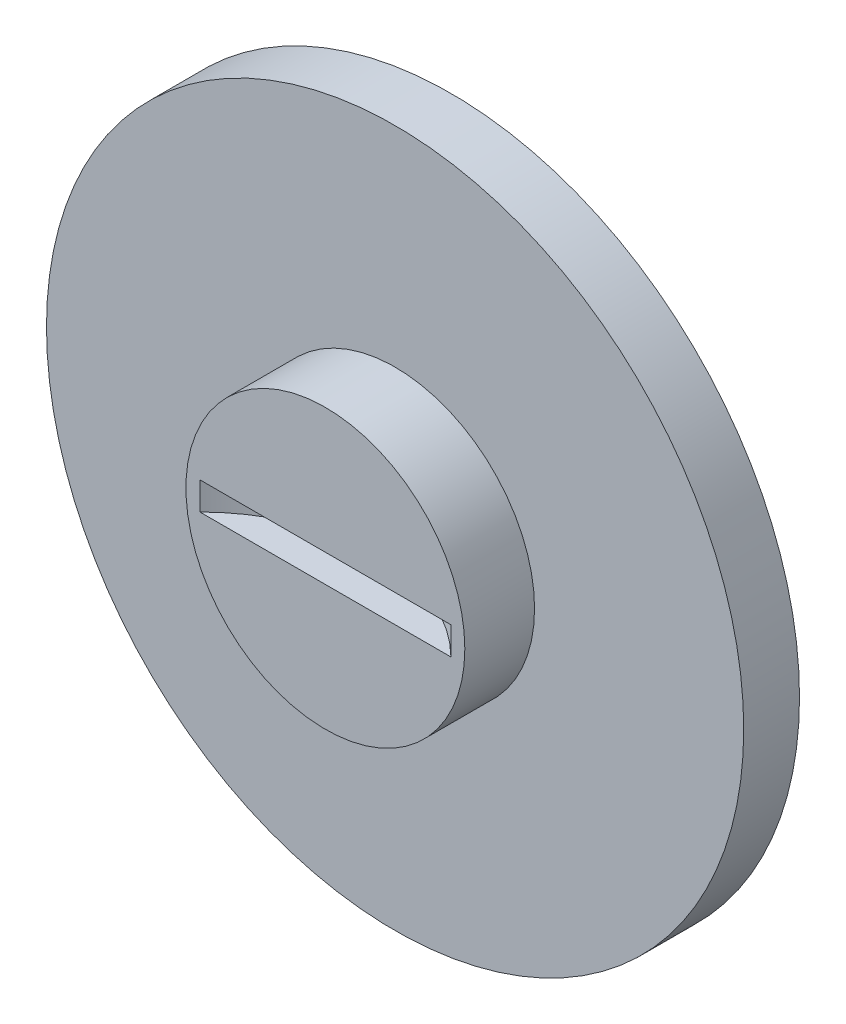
ISO-10303-21;
HEADER;
FILE_DESCRIPTION(('STEP AP214'),'2;1');
FILE_NAME('part.step','',(''),(''),'','','');
FILE_SCHEMA(('AUTOMOTIVE_DESIGN { 1 0 10303 214 1 1 1 1 }'));
ENDSEC;
DATA;
#1=APPLICATION_CONTEXT('core data for automotive mechanical design processes');
#2=APPLICATION_PROTOCOL_DEFINITION('international standard','automotive_design',2000,#1);
#3=PRODUCT_CONTEXT('',#1,'mechanical');
#4=PRODUCT('Part','Part','',(#3));
#5=PRODUCT_RELATED_PRODUCT_CATEGORY('part','',(#4));
#6=PRODUCT_DEFINITION_FORMATION('','',#4);
#7=PRODUCT_DEFINITION_CONTEXT('part definition',#1,'design');
#8=PRODUCT_DEFINITION('design','',#6,#7);
#9=PRODUCT_DEFINITION_SHAPE('','',#8);
#10=(LENGTH_UNIT() NAMED_UNIT(*) SI_UNIT(.MILLI.,.METRE.));
#11=(NAMED_UNIT(*) PLANE_ANGLE_UNIT() SI_UNIT($,.RADIAN.));
#12=(NAMED_UNIT(*) SI_UNIT($,.STERADIAN.) SOLID_ANGLE_UNIT());
#13=UNCERTAINTY_MEASURE_WITH_UNIT(LENGTH_MEASURE(1.E-05),#10,'distance_accuracy_value','');
#14=(GEOMETRIC_REPRESENTATION_CONTEXT(3) GLOBAL_UNCERTAINTY_ASSIGNED_CONTEXT((#13)) GLOBAL_UNIT_ASSIGNED_CONTEXT((#10,
#11,#12)) REPRESENTATION_CONTEXT('',''));
#15=CARTESIAN_POINT('',(0.,0.,0.));
#16=DIRECTION('',(0.,0.,1.));
#17=DIRECTION('',(1.,0.,0.));
#18=AXIS2_PLACEMENT_3D('',#15,#16,#17);
#19=CARTESIAN_POINT('',(0.,0.,0.));
#20=DIRECTION('',(0.,0.,1.));
#21=DIRECTION('',(1.,0.,0.));
#22=AXIS2_PLACEMENT_3D('',#19,#20,#21);
#23=PLANE('',#22);
#24=CARTESIAN_POINT('',(0.,0.,0.));
#25=DIRECTION('',(0.,0.,1.));
#26=DIRECTION('',(1.,0.,0.));
#27=AXIS2_PLACEMENT_3D('',#24,#25,#26);
#28=CIRCLE('',#27,25.);
#29=CARTESIAN_POINT('',(25.,0.,0.));
#30=VERTEX_POINT('',#29);
#31=EDGE_CURVE('E79',#30,#30,#28,.T.);
#32=ORIENTED_EDGE('',*,*,#31,.T.);
#33=EDGE_LOOP('',(#32));
#34=FACE_BOUND('',#33,.T.);
#35=CARTESIAN_POINT('',(0.,0.,0.));
#36=DIRECTION('',(0.,0.,1.));
#37=DIRECTION('',(1.,0.,0.));
#38=AXIS2_PLACEMENT_3D('',#35,#36,#37);
#39=CIRCLE('',#38,10.);
#40=CARTESIAN_POINT('',(10.,0.,0.));
#41=VERTEX_POINT('',#40);
#42=EDGE_CURVE('E72',#41,#41,#39,.T.);
#43=ORIENTED_EDGE('',*,*,#42,.F.);
#44=EDGE_LOOP('',(#43));
#45=FACE_BOUND('',#44,.T.);
#46=ADVANCED_FACE('F32',(#34,#45),#23,.T.);
#47=CARTESIAN_POINT('',(0.,0.,-4.));
#48=DIRECTION('',(0.,0.,1.));
#49=DIRECTION('',(1.,0.,0.));
#50=AXIS2_PLACEMENT_3D('',#47,#48,#49);
#51=CYLINDRICAL_SURFACE('',#50,25.);
#52=CARTESIAN_POINT('',(0.,0.,-4.));
#53=DIRECTION('',(0.,0.,1.));
#54=DIRECTION('',(1.,0.,0.));
#55=AXIS2_PLACEMENT_3D('',#52,#53,#54);
#56=CIRCLE('',#55,25.);
#57=CARTESIAN_POINT('',(25.,0.,-4.));
#58=VERTEX_POINT('',#57);
#59=EDGE_CURVE('E62',#58,#58,#56,.T.);
#60=ORIENTED_EDGE('',*,*,#59,.T.);
#61=EDGE_LOOP('',(#60));
#62=FACE_BOUND('',#61,.T.);
#63=ORIENTED_EDGE('',*,*,#31,.F.);
#64=EDGE_LOOP('',(#63));
#65=FACE_BOUND('',#64,.T.);
#66=ADVANCED_FACE('F34',(#62,#65),#51,.T.);
#67=CARTESIAN_POINT('',(0.,0.,-4.));
#68=DIRECTION('',(0.,0.,1.));
#69=DIRECTION('',(1.,0.,0.));
#70=AXIS2_PLACEMENT_3D('',#67,#68,#69);
#71=PLANE('',#70);
#72=ORIENTED_EDGE('',*,*,#59,.F.);
#73=EDGE_LOOP('',(#72));
#74=FACE_BOUND('',#73,.T.);
#75=ADVANCED_FACE('F90',(#74),#71,.F.);
#76=CARTESIAN_POINT('',(0.,0.,5.));
#77=DIRECTION('',(0.,0.,-1.));
#78=DIRECTION('',(-1.,0.,0.));
#79=AXIS2_PLACEMENT_3D('',#76,#77,#78);
#80=CYLINDRICAL_SURFACE('',#79,10.);
#81=CARTESIAN_POINT('',(0.,0.,5.));
#82=DIRECTION('',(0.,0.,1.));
#83=DIRECTION('',(1.,0.,0.));
#84=AXIS2_PLACEMENT_3D('',#81,#82,#83);
#85=CIRCLE('',#84,10.);
#86=CARTESIAN_POINT('',(10.,0.,5.));
#87=VERTEX_POINT('',#86);
#88=EDGE_CURVE('E76',#87,#87,#85,.T.);
#89=ORIENTED_EDGE('',*,*,#88,.F.);
#90=EDGE_LOOP('',(#89));
#91=FACE_BOUND('',#90,.T.);
#92=ORIENTED_EDGE('',*,*,#42,.T.);
#93=EDGE_LOOP('',(#92));
#94=FACE_BOUND('',#93,.T.);
#95=ADVANCED_FACE('F96',(#91,#94),#80,.T.);
#96=CARTESIAN_POINT('',(0.,0.,5.));
#97=DIRECTION('',(0.,0.,1.));
#98=DIRECTION('',(1.,0.,0.));
#99=AXIS2_PLACEMENT_3D('',#96,#97,#98);
#100=PLANE('',#99);
#101=DIRECTION('',(1.,0.,0.));
#102=VECTOR('',#101,1.);
#103=CARTESIAN_POINT('',(0.,-1.,5.));
#104=LINE('',#103,#102);
#105=CARTESIAN_POINT('',(-9.,-1.,5.));
#106=VERTEX_POINT('',#105);
#107=CARTESIAN_POINT('',(9.,-1.,5.));
#108=VERTEX_POINT('',#107);
#109=EDGE_CURVE('E11',#106,#108,#104,.T.);
#110=ORIENTED_EDGE('',*,*,#109,.F.);
#111=DIRECTION('',(0.,1.,0.));
#112=VECTOR('',#111,1.);
#113=CARTESIAN_POINT('',(-9.,-1.,5.));
#114=LINE('',#113,#112);
#115=CARTESIAN_POINT('',(-9.,1.,5.));
#116=VERTEX_POINT('',#115);
#117=EDGE_CURVE('E65',#106,#116,#114,.T.);
#118=ORIENTED_EDGE('',*,*,#117,.T.);
#119=DIRECTION('',(1.,0.,0.));
#120=VECTOR('',#119,1.);
#121=CARTESIAN_POINT('',(0.,1.,5.));
#122=LINE('',#121,#120);
#123=CARTESIAN_POINT('',(9.,1.,5.));
#124=VERTEX_POINT('',#123);
#125=EDGE_CURVE('E40',#116,#124,#122,.T.);
#126=ORIENTED_EDGE('',*,*,#125,.T.);
#127=DIRECTION('',(0.,1.,0.));
#128=VECTOR('',#127,1.);
#129=CARTESIAN_POINT('',(9.,-1.,5.));
#130=LINE('',#129,#128);
#131=EDGE_CURVE('E66',#108,#124,#130,.T.);
#132=ORIENTED_EDGE('',*,*,#131,.F.);
#133=EDGE_LOOP('',(#110,#118,#126,#132));
#134=FACE_BOUND('',#133,.T.);
#135=ORIENTED_EDGE('',*,*,#88,.T.);
#136=EDGE_LOOP('',(#135));
#137=FACE_BOUND('',#136,.T.);
#138=ADVANCED_FACE('F69',(#134,#137),#100,.T.);
#139=CARTESIAN_POINT('',(0.,-1.,14.));
#140=DIRECTION('',(0.,1.,0.));
#141=DIRECTION('',(0.,0.,1.));
#142=AXIS2_PLACEMENT_3D('',#139,#140,#141);
#143=CYLINDRICAL_SURFACE('',#142,12.7279220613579);
#144=CARTESIAN_POINT('',(0.,1.,14.));
#145=DIRECTION('',(0.,1.,0.));
#146=DIRECTION('',(0.,0.,-1.));
#147=AXIS2_PLACEMENT_3D('',#144,#145,#146);
#148=CIRCLE('',#147,12.7279220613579);
#149=EDGE_CURVE('E46',#124,#116,#148,.T.);
#150=ORIENTED_EDGE('',*,*,#149,.T.);
#151=ORIENTED_EDGE('',*,*,#117,.F.);
#152=CARTESIAN_POINT('',(0.,-1.,14.));
#153=DIRECTION('',(0.,1.,0.));
#154=DIRECTION('',(0.,0.,-1.));
#155=AXIS2_PLACEMENT_3D('',#152,#153,#154);
#156=CIRCLE('',#155,12.7279220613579);
#157=EDGE_CURVE('E67',#108,#106,#156,.T.);
#158=ORIENTED_EDGE('',*,*,#157,.F.);
#159=ORIENTED_EDGE('',*,*,#131,.T.);
#160=EDGE_LOOP('',(#150,#151,#158,#159));
#161=FACE_BOUND('',#160,.T.);
#162=ADVANCED_FACE('F64',(#161),#143,.F.);
#163=CARTESIAN_POINT('',(0.,-1.,14.));
#164=DIRECTION('',(0.,-1.,0.));
#165=DIRECTION('',(0.,0.,-1.));
#166=AXIS2_PLACEMENT_3D('',#163,#164,#165);
#167=PLANE('',#166);
#168=ORIENTED_EDGE('',*,*,#109,.T.);
#169=ORIENTED_EDGE('',*,*,#157,.T.);
#170=EDGE_LOOP('',(#168,#169));
#171=FACE_BOUND('',#170,.T.);
#172=ADVANCED_FACE('F110',(#171),#167,.F.);
#173=CARTESIAN_POINT('',(0.,1.,14.));
#174=DIRECTION('',(0.,-1.,0.));
#175=DIRECTION('',(0.,0.,-1.));
#176=AXIS2_PLACEMENT_3D('',#173,#174,#175);
#177=PLANE('',#176);
#178=ORIENTED_EDGE('',*,*,#149,.F.);
#179=ORIENTED_EDGE('',*,*,#125,.F.);
#180=EDGE_LOOP('',(#178,#179));
#181=FACE_BOUND('',#180,.T.);
#182=ADVANCED_FACE('F58',(#181),#177,.T.);
#183=CLOSED_SHELL('',(#46,#66,#75,#95,#138,#162,#172,#182));
#184=MANIFOLD_SOLID_BREP('B2',#183);
#185=ADVANCED_BREP_SHAPE_REPRESENTATION('',(#18,#184),#14);
#186=SHAPE_DEFINITION_REPRESENTATION(#9,#185);
ENDSEC;
END-ISO-10303-21;
